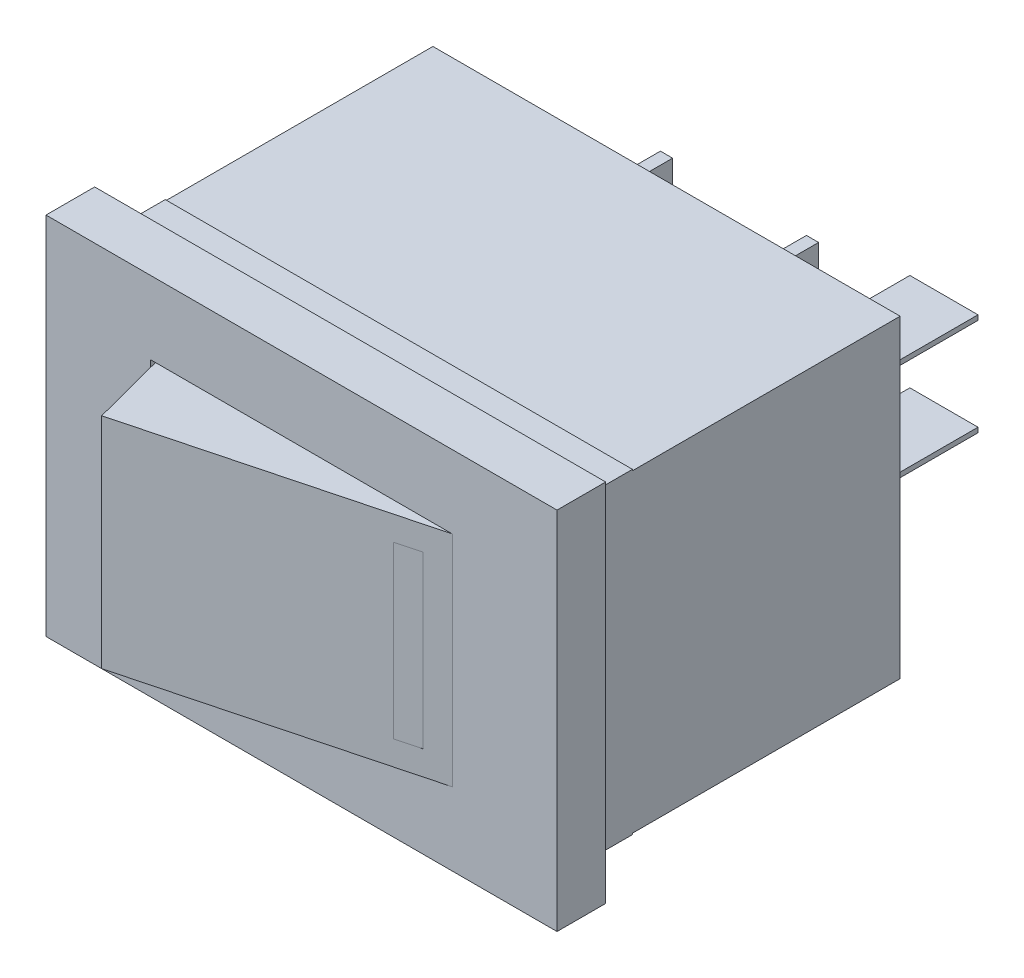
from build123d import *

# Parameters (mm, degrees)
SKETCH1_W                = 21
SKETCH1_H                = 15
BOSS_EXTRUDE1_DEPTH      = 2
SKETCH2_W                = 19.2
SKETCH2_H                = 12.9
BOSS_EXTRUDE2_DEPTH      = 13
SKETCH3_W                = 0.5
SKETCH3_H                = 2.8
BOSS_EXTRUDE3_DEPTH      = 6
BOSS_EXTRUDE3_2_DEPTH    = 6
SKETCH3_W_2              = 2.8
SKETCH3_H_2              = 0.2
BOSS_EXTRUDE3_3_DEPTH    = 6
BOSS_EXTRUDE3_4_DEPTH    = 6
SKETCH4_W                = 12.4
SKETCH4_H                = 9
CUT_EXTRUDE1_DEPTH       = 6
BOSS_EXTRUDE8_DEPTH      = 4.5
BOSS_EXTRUDE8_DEPTH_BACK = 4.5
SKETCH6_W                = 1
SKETCH6_H                = 7
CUT_EXTRUDE2_DEPTH       = 0.001
SKETCH7_W                = 19.2
SKETCH7_H                = 0.05
BOSS_EXTRUDE9_DEPTH      = 2


with BuildPart() as part:
    # Sketch1 → Boss-Extrude1 (new body)
    with BuildSketch(Plane.XY):
        Rectangle(SKETCH1_W, SKETCH1_H)
    extrude(amount=BOSS_EXTRUDE1_DEPTH)

    # Sketch2 → Boss-Extrude2 (add)
    with BuildSketch(Plane(origin=(0, 0, 0), x_dir=(-1, 0, 0), z_dir=(0, 0, -1))):
        Rectangle(SKETCH2_W, SKETCH2_H)
    extrude(amount=BOSS_EXTRUDE2_DEPTH)

    # Sketch4 → Cut-Extrude1 (cut)
    with BuildSketch(Plane.XY.offset(2)):
        Rectangle(SKETCH4_W, SKETCH4_H)
    extrude(amount=-CUT_EXTRUDE1_DEPTH, mode=Mode.SUBTRACT)

    # Sketch7 → Boss-Extrude9 (add)
    with BuildSketch(Plane(origin=(0, 0, 0), x_dir=(-1, 0, 0), z_dir=(0, 0, -1))):
        with Locations((0, -6.475)):
            Rectangle(SKETCH7_W, SKETCH7_H)
        with Locations((0, 6.475)):
            Rectangle(SKETCH7_W, SKETCH7_H)
    extrude(amount=BOSS_EXTRUDE9_DEPTH)


with BuildPart() as body_2:
    # Sketch3 → Boss-Extrude3 (new body)
    with BuildSketch(Plane(origin=(0, 0, -13), x_dir=(-1, 0, 0), z_dir=(0, 0, -1))):
        Rectangle(SKETCH3_W, SKETCH3_H)
    extrude(amount=BOSS_EXTRUDE3_DEPTH)


with BuildPart() as body_3:
    # Sketch3 → Boss-Extrude3 2 (new body)
    with BuildSketch(Plane(origin=(0, 0, -13), x_dir=(-1, 0, 0), z_dir=(0, 0, -1))):
        with Locations((6, 0)):
            Rectangle(SKETCH3_W, SKETCH3_H)
    extrude(amount=BOSS_EXTRUDE3_2_DEPTH)


with BuildPart() as body_4:
    # Sketch3 → Boss-Extrude3 3 (new body)
    with BuildSketch(Plane(origin=(0, 0, -13), x_dir=(-1, 0, 0), z_dir=(0, 0, -1))):
        with Locations((-5.4, 2)):
            Rectangle(SKETCH3_W_2, SKETCH3_H_2)
    extrude(amount=BOSS_EXTRUDE3_3_DEPTH)


with BuildPart() as body_5:
    # Sketch3 → Boss-Extrude3 4 (new body)
    with BuildSketch(Plane(origin=(0, 0, -13), x_dir=(-1, 0, 0), z_dir=(0, 0, -1))):
        with Locations((-5.4, -2)):
            Rectangle(SKETCH3_W_2, SKETCH3_H_2)
    extrude(amount=BOSS_EXTRUDE3_4_DEPTH)


with BuildPart() as body_6:
    # 3DSketch1 → Boss-Extrude8 (new, two sides: drawn at the far end of the back side and taken through both)
    with BuildSketch(Plane(origin=(6.2, 0, 2), x_dir=(-0.9936815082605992, 0, -0.11223662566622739), z_dir=(0, 1, 0)).offset(-BOSS_EXTRUDE8_DEPTH_BACK)):
        Polygon((0, 0), (11.003972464, 4.260585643), (12.653612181, 0), (1.649639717, -4.260585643), align=None)
    extrude(amount=BOSS_EXTRUDE8_DEPTH + BOSS_EXTRUDE8_DEPTH_BACK)

    # Sketch6 → Cut-Extrude2 (cut)
    with BuildSketch(Plane(origin=(0.891933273, 0, 3.394669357), x_dir=(0.9671726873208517, 0, -0.2541200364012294), z_dir=(0.2541200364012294, 0, 0.9671726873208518))):
        with Locations((4, 0)):
            Rectangle(SKETCH6_W, SKETCH6_H)
    extrude(amount=-CUT_EXTRUDE2_DEPTH, mode=Mode.SUBTRACT)


solid = Compound([part.part, body_2.part, body_3.part, body_4.part, body_5.part, body_6.part])
